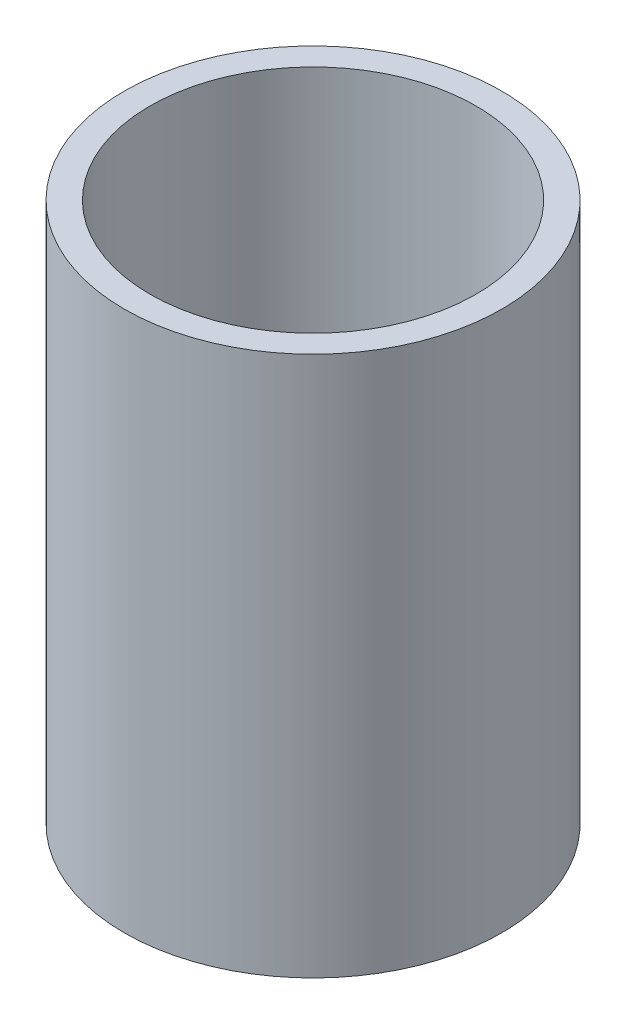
from build123d import *

# Parameters (mm, degrees)
SKETCH1_W = 6.35
SKETCH1_H = 133.35


with BuildPart() as part:
    # Sketch1 → Revolve1 (revolve)
    with BuildSketch(Plane.XY, mode=Mode.PRIVATE) as revolve1_sk:
        with Locations((-43.434, -21.057365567)):
            Rectangle(SKETCH1_W, SKETCH1_H)
    revolve(revolve1_sk.sketch.rotate(Axis((0, 55, 0), (0, -1, 0)), 270), axis=Axis((0, 55, 0), (0, -1, 0)))


solid = part.part
